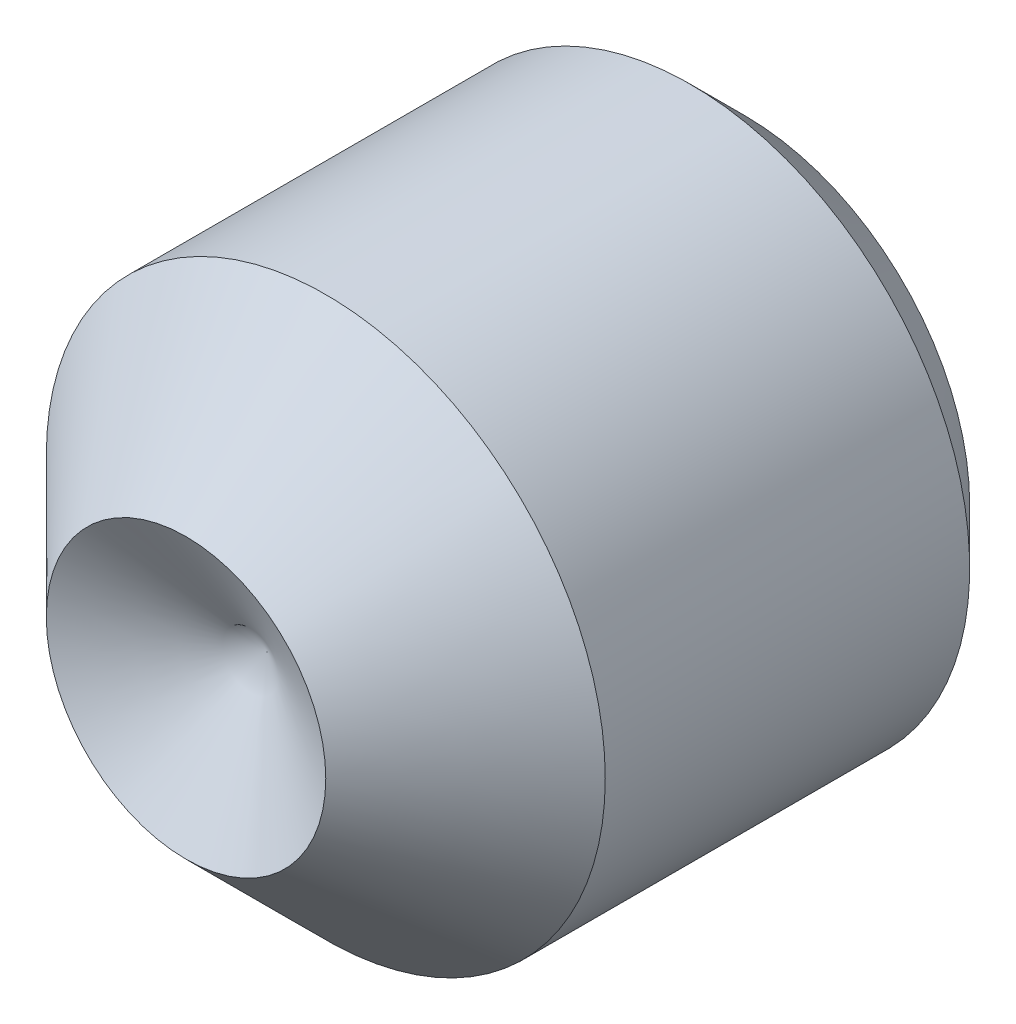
ISO-10303-21;
HEADER;
FILE_DESCRIPTION(('STEP AP214'),'2;1');
FILE_NAME('part.step','',(''),(''),'','','');
FILE_SCHEMA(('AUTOMOTIVE_DESIGN { 1 0 10303 214 1 1 1 1 }'));
ENDSEC;
DATA;
#1=APPLICATION_CONTEXT('core data for automotive mechanical design processes');
#2=APPLICATION_PROTOCOL_DEFINITION('international standard','automotive_design',2000,#1);
#3=PRODUCT_CONTEXT('',#1,'mechanical');
#4=PRODUCT('Part','Part','',(#3));
#5=PRODUCT_RELATED_PRODUCT_CATEGORY('part','',(#4));
#6=PRODUCT_DEFINITION_FORMATION('','',#4);
#7=PRODUCT_DEFINITION_CONTEXT('part definition',#1,'design');
#8=PRODUCT_DEFINITION('design','',#6,#7);
#9=PRODUCT_DEFINITION_SHAPE('','',#8);
#10=(LENGTH_UNIT() NAMED_UNIT(*) SI_UNIT(.MILLI.,.METRE.));
#11=(NAMED_UNIT(*) PLANE_ANGLE_UNIT() SI_UNIT($,.RADIAN.));
#12=(NAMED_UNIT(*) SI_UNIT($,.STERADIAN.) SOLID_ANGLE_UNIT());
#13=UNCERTAINTY_MEASURE_WITH_UNIT(LENGTH_MEASURE(1.E-05),#10,'distance_accuracy_value','');
#14=(GEOMETRIC_REPRESENTATION_CONTEXT(3) GLOBAL_UNCERTAINTY_ASSIGNED_CONTEXT((#13)) GLOBAL_UNIT_ASSIGNED_CONTEXT((#10,
#11,#12)) REPRESENTATION_CONTEXT('',''));
#15=CARTESIAN_POINT('',(0.,0.,0.));
#16=DIRECTION('',(0.,0.,1.));
#17=DIRECTION('',(1.,0.,0.));
#18=AXIS2_PLACEMENT_3D('',#15,#16,#17);
#19=CARTESIAN_POINT('',(0.,0.,-10.5851546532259));
#20=DIRECTION('',(0.,0.,-1.));
#21=DIRECTION('',(-1.,0.,0.));
#22=AXIS2_PLACEMENT_3D('',#19,#20,#21);
#23=CYLINDRICAL_SURFACE('',#22,3.175);
#24=CARTESIAN_POINT('',(0.,0.,0.622299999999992));
#25=DIRECTION('',(0.,0.,-1.));
#26=DIRECTION('',(-1.,0.,0.));
#27=AXIS2_PLACEMENT_3D('',#24,#25,#26);
#28=CIRCLE('',#27,3.175);
#29=CARTESIAN_POINT('',(-3.175,0.,0.622299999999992));
#30=VERTEX_POINT('',#29);
#31=EDGE_CURVE('E58',#30,#30,#28,.T.);
#32=ORIENTED_EDGE('',*,*,#31,.F.);
#33=EDGE_LOOP('',(#32));
#34=FACE_BOUND('',#33,.T.);
#35=CARTESIAN_POINT('',(0.,0.,4.76249999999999));
#36=DIRECTION('',(0.,0.,1.));
#37=DIRECTION('',(1.,0.,0.));
#38=AXIS2_PLACEMENT_3D('',#35,#36,#37);
#39=CIRCLE('',#38,3.175);
#40=CARTESIAN_POINT('',(3.175,0.,4.76249999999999));
#41=VERTEX_POINT('',#40);
#42=EDGE_CURVE('E188',#41,#41,#39,.T.);
#43=ORIENTED_EDGE('',*,*,#42,.F.);
#44=EDGE_LOOP('',(#43));
#45=FACE_BOUND('',#44,.T.);
#46=ADVANCED_FACE('F49',(#34,#45),#23,.T.);
#47=CARTESIAN_POINT('',(0.,0.,0.));
#48=DIRECTION('',(0.,0.,1.));
#49=DIRECTION('',(1.,0.,0.));
#50=AXIS2_PLACEMENT_3D('',#47,#48,#49);
#51=PLANE('',#50);
#52=DIRECTION('',(-0.5,-0.866025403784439,0.));
#53=VECTOR('',#52,1.);
#54=CARTESIAN_POINT('',(1.83308710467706,0.,0.));
#55=LINE('',#54,#53);
#56=CARTESIAN_POINT('',(1.83308710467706,0.,0.));
#57=VERTEX_POINT('',#56);
#58=CARTESIAN_POINT('',(0.916543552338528,-1.58750000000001,0.));
#59=VERTEX_POINT('',#58);
#60=EDGE_CURVE('E148',#57,#59,#55,.T.);
#61=ORIENTED_EDGE('',*,*,#60,.F.);
#62=DIRECTION('',(0.5,-0.866025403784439,0.));
#63=VECTOR('',#62,1.);
#64=CARTESIAN_POINT('',(0.916543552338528,1.58750000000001,0.));
#65=LINE('',#64,#63);
#66=CARTESIAN_POINT('',(0.916543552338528,1.58750000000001,0.));
#67=VERTEX_POINT('',#66);
#68=EDGE_CURVE('E65',#67,#57,#65,.T.);
#69=ORIENTED_EDGE('',*,*,#68,.F.);
#70=DIRECTION('',(1.,0.,0.));
#71=VECTOR('',#70,1.);
#72=CARTESIAN_POINT('',(-0.916543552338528,1.58750000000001,0.));
#73=LINE('',#72,#71);
#74=CARTESIAN_POINT('',(-0.916543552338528,1.58750000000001,0.));
#75=VERTEX_POINT('',#74);
#76=EDGE_CURVE('E162',#75,#67,#73,.T.);
#77=ORIENTED_EDGE('',*,*,#76,.F.);
#78=DIRECTION('',(0.5,0.866025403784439,0.));
#79=VECTOR('',#78,1.);
#80=CARTESIAN_POINT('',(-1.83308710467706,0.,0.));
#81=LINE('',#80,#79);
#82=CARTESIAN_POINT('',(-1.83308710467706,0.,0.));
#83=VERTEX_POINT('',#82);
#84=EDGE_CURVE('E159',#83,#75,#81,.T.);
#85=ORIENTED_EDGE('',*,*,#84,.F.);
#86=DIRECTION('',(-0.5,0.866025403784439,0.));
#87=VECTOR('',#86,1.);
#88=CARTESIAN_POINT('',(-0.916543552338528,-1.58750000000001,0.));
#89=LINE('',#88,#87);
#90=CARTESIAN_POINT('',(-0.916543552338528,-1.58750000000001,0.));
#91=VERTEX_POINT('',#90);
#92=EDGE_CURVE('E115',#91,#83,#89,.T.);
#93=ORIENTED_EDGE('',*,*,#92,.F.);
#94=DIRECTION('',(-1.,0.,0.));
#95=VECTOR('',#94,1.);
#96=CARTESIAN_POINT('',(0.916543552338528,-1.58750000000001,0.));
#97=LINE('',#96,#95);
#98=EDGE_CURVE('E153',#59,#91,#97,.T.);
#99=ORIENTED_EDGE('',*,*,#98,.F.);
#100=EDGE_LOOP('',(#61,#69,#77,#85,#93,#99));
#101=FACE_BOUND('',#100,.T.);
#102=CARTESIAN_POINT('',(0.,0.,0.));
#103=DIRECTION('',(0.,0.,-1.));
#104=DIRECTION('',(-1.,0.,0.));
#105=AXIS2_PLACEMENT_3D('',#102,#103,#104);
#106=CIRCLE('',#105,2.5527);
#107=CARTESIAN_POINT('',(-2.5527,0.,0.));
#108=VERTEX_POINT('',#107);
#109=EDGE_CURVE('E11',#108,#108,#106,.T.);
#110=ORIENTED_EDGE('',*,*,#109,.T.);
#111=EDGE_LOOP('',(#110));
#112=FACE_BOUND('',#111,.T.);
#113=ADVANCED_FACE('F51',(#101,#112),#51,.F.);
#114=CARTESIAN_POINT('',(0.,0.,0.622299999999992));
#115=DIRECTION('',(0.,0.,1.));
#116=DIRECTION('',(1.,0.,0.));
#117=AXIS2_PLACEMENT_3D('',#114,#115,#116);
#118=CONICAL_SURFACE('',#117,3.175,0.785398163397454);
#119=ORIENTED_EDGE('',*,*,#109,.F.);
#120=EDGE_LOOP('',(#119));
#121=FACE_BOUND('',#120,.T.);
#122=ORIENTED_EDGE('',*,*,#31,.T.);
#123=EDGE_LOOP('',(#122));
#124=FACE_BOUND('',#123,.T.);
#125=ADVANCED_FACE('F181',(#121,#124),#118,.T.);
#126=CARTESIAN_POINT('',(0.916543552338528,1.58750000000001,2.5));
#127=DIRECTION('',(0.866025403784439,0.5,0.));
#128=DIRECTION('',(-0.5,0.866025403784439,0.));
#129=AXIS2_PLACEMENT_3D('',#126,#127,#128);
#130=PLANE('',#129);
#131=ORIENTED_EDGE('',*,*,#68,.T.);
#132=DIRECTION('',(0.,0.,-1.));
#133=VECTOR('',#132,1.);
#134=CARTESIAN_POINT('',(1.83308710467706,0.,2.5));
#135=LINE('',#134,#133);
#136=CARTESIAN_POINT('',(1.83308710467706,0.,2.5));
#137=VERTEX_POINT('',#136);
#138=EDGE_CURVE('E96',#137,#57,#135,.T.);
#139=ORIENTED_EDGE('',*,*,#138,.F.);
#140=DIRECTION('',(0.5,-0.866025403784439,0.));
#141=VECTOR('',#140,1.);
#142=CARTESIAN_POINT('',(0.916543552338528,1.58750000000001,2.5));
#143=LINE('',#142,#141);
#144=CARTESIAN_POINT('',(0.916543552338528,1.58750000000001,2.5));
#145=VERTEX_POINT('',#144);
#146=EDGE_CURVE('E165',#145,#137,#143,.T.);
#147=ORIENTED_EDGE('',*,*,#146,.F.);
#148=DIRECTION('',(0.,0.,-1.));
#149=VECTOR('',#148,1.);
#150=CARTESIAN_POINT('',(0.916543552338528,1.58750000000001,2.5));
#151=LINE('',#150,#149);
#152=EDGE_CURVE('E73',#145,#67,#151,.T.);
#153=ORIENTED_EDGE('',*,*,#152,.T.);
#154=EDGE_LOOP('',(#131,#139,#147,#153));
#155=FACE_BOUND('',#154,.T.);
#156=ADVANCED_FACE('F211',(#155),#130,.F.);
#157=CARTESIAN_POINT('',(-0.916543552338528,1.58750000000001,2.5));
#158=DIRECTION('',(0.,1.,0.));
#159=DIRECTION('',(-1.,0.,0.));
#160=AXIS2_PLACEMENT_3D('',#157,#158,#159);
#161=PLANE('',#160);
#162=ORIENTED_EDGE('',*,*,#76,.T.);
#163=ORIENTED_EDGE('',*,*,#152,.F.);
#164=DIRECTION('',(1.,0.,0.));
#165=VECTOR('',#164,1.);
#166=CARTESIAN_POINT('',(-0.916543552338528,1.58750000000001,2.5));
#167=LINE('',#166,#165);
#168=CARTESIAN_POINT('',(-0.916543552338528,1.58750000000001,2.5));
#169=VERTEX_POINT('',#168);
#170=EDGE_CURVE('E129',#169,#145,#167,.T.);
#171=ORIENTED_EDGE('',*,*,#170,.F.);
#172=DIRECTION('',(0.,0.,-1.));
#173=VECTOR('',#172,1.);
#174=CARTESIAN_POINT('',(-0.916543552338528,1.58750000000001,2.5));
#175=LINE('',#174,#173);
#176=EDGE_CURVE('E120',#169,#75,#175,.T.);
#177=ORIENTED_EDGE('',*,*,#176,.T.);
#178=EDGE_LOOP('',(#162,#163,#171,#177));
#179=FACE_BOUND('',#178,.T.);
#180=ADVANCED_FACE('F209',(#179),#161,.F.);
#181=CARTESIAN_POINT('',(-1.83308710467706,0.,2.5));
#182=DIRECTION('',(-0.866025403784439,0.5,0.));
#183=DIRECTION('',(-0.5,-0.866025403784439,0.));
#184=AXIS2_PLACEMENT_3D('',#181,#182,#183);
#185=PLANE('',#184);
#186=ORIENTED_EDGE('',*,*,#84,.T.);
#187=ORIENTED_EDGE('',*,*,#176,.F.);
#188=DIRECTION('',(0.5,0.866025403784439,0.));
#189=VECTOR('',#188,1.);
#190=CARTESIAN_POINT('',(-1.83308710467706,0.,2.5));
#191=LINE('',#190,#189);
#192=CARTESIAN_POINT('',(-1.83308710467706,0.,2.5));
#193=VERTEX_POINT('',#192);
#194=EDGE_CURVE('E124',#193,#169,#191,.T.);
#195=ORIENTED_EDGE('',*,*,#194,.F.);
#196=DIRECTION('',(0.,0.,-1.));
#197=VECTOR('',#196,1.);
#198=CARTESIAN_POINT('',(-1.83308710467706,0.,2.5));
#199=LINE('',#198,#197);
#200=EDGE_CURVE('E108',#193,#83,#199,.T.);
#201=ORIENTED_EDGE('',*,*,#200,.T.);
#202=EDGE_LOOP('',(#186,#187,#195,#201));
#203=FACE_BOUND('',#202,.T.);
#204=ADVANCED_FACE('F125',(#203),#185,.F.);
#205=CARTESIAN_POINT('',(-0.916543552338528,-1.58750000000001,2.5));
#206=DIRECTION('',(-0.866025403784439,-0.5,0.));
#207=DIRECTION('',(0.5,-0.866025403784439,0.));
#208=AXIS2_PLACEMENT_3D('',#205,#206,#207);
#209=PLANE('',#208);
#210=ORIENTED_EDGE('',*,*,#92,.T.);
#211=ORIENTED_EDGE('',*,*,#200,.F.);
#212=DIRECTION('',(-0.5,0.866025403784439,0.));
#213=VECTOR('',#212,1.);
#214=CARTESIAN_POINT('',(-0.916543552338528,-1.58750000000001,2.5));
#215=LINE('',#214,#213);
#216=CARTESIAN_POINT('',(-0.916543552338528,-1.58750000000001,2.5));
#217=VERTEX_POINT('',#216);
#218=EDGE_CURVE('E112',#217,#193,#215,.T.);
#219=ORIENTED_EDGE('',*,*,#218,.F.);
#220=DIRECTION('',(0.,0.,-1.));
#221=VECTOR('',#220,1.);
#222=CARTESIAN_POINT('',(-0.916543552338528,-1.58750000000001,2.5));
#223=LINE('',#222,#221);
#224=EDGE_CURVE('E121',#217,#91,#223,.T.);
#225=ORIENTED_EDGE('',*,*,#224,.T.);
#226=EDGE_LOOP('',(#210,#211,#219,#225));
#227=FACE_BOUND('',#226,.T.);
#228=ADVANCED_FACE('F110',(#227),#209,.F.);
#229=CARTESIAN_POINT('',(0.916543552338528,-1.58750000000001,2.5));
#230=DIRECTION('',(0.,-1.,0.));
#231=DIRECTION('',(1.,0.,0.));
#232=AXIS2_PLACEMENT_3D('',#229,#230,#231);
#233=PLANE('',#232);
#234=ORIENTED_EDGE('',*,*,#98,.T.);
#235=ORIENTED_EDGE('',*,*,#224,.F.);
#236=DIRECTION('',(-1.,0.,0.));
#237=VECTOR('',#236,1.);
#238=CARTESIAN_POINT('',(0.916543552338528,-1.58750000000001,2.5));
#239=LINE('',#238,#237);
#240=CARTESIAN_POINT('',(0.916543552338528,-1.58750000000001,2.5));
#241=VERTEX_POINT('',#240);
#242=EDGE_CURVE('E135',#241,#217,#239,.T.);
#243=ORIENTED_EDGE('',*,*,#242,.F.);
#244=DIRECTION('',(0.,0.,-1.));
#245=VECTOR('',#244,1.);
#246=CARTESIAN_POINT('',(0.916543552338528,-1.58750000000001,2.5));
#247=LINE('',#246,#245);
#248=EDGE_CURVE('E172',#241,#59,#247,.T.);
#249=ORIENTED_EDGE('',*,*,#248,.T.);
#250=EDGE_LOOP('',(#234,#235,#243,#249));
#251=FACE_BOUND('',#250,.T.);
#252=ADVANCED_FACE('F205',(#251),#233,.F.);
#253=CARTESIAN_POINT('',(1.83308710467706,0.,2.5));
#254=DIRECTION('',(0.866025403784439,-0.5,0.));
#255=DIRECTION('',(0.5,0.866025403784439,0.));
#256=AXIS2_PLACEMENT_3D('',#253,#254,#255);
#257=PLANE('',#256);
#258=ORIENTED_EDGE('',*,*,#60,.T.);
#259=ORIENTED_EDGE('',*,*,#248,.F.);
#260=DIRECTION('',(-0.5,-0.866025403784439,0.));
#261=VECTOR('',#260,1.);
#262=CARTESIAN_POINT('',(1.83308710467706,0.,2.5));
#263=LINE('',#262,#261);
#264=EDGE_CURVE('E140',#137,#241,#263,.T.);
#265=ORIENTED_EDGE('',*,*,#264,.F.);
#266=ORIENTED_EDGE('',*,*,#138,.T.);
#267=EDGE_LOOP('',(#258,#259,#265,#266));
#268=FACE_BOUND('',#267,.T.);
#269=ADVANCED_FACE('F201',(#268),#257,.F.);
#270=CARTESIAN_POINT('',(0.916543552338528,1.58750000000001,2.5));
#271=DIRECTION('',(0.,0.,1.));
#272=DIRECTION('',(1.,0.,0.));
#273=AXIS2_PLACEMENT_3D('',#270,#271,#272);
#274=PLANE('',#273);
#275=ORIENTED_EDGE('',*,*,#146,.T.);
#276=ORIENTED_EDGE('',*,*,#264,.T.);
#277=ORIENTED_EDGE('',*,*,#242,.T.);
#278=ORIENTED_EDGE('',*,*,#218,.T.);
#279=ORIENTED_EDGE('',*,*,#194,.T.);
#280=ORIENTED_EDGE('',*,*,#170,.T.);
#281=EDGE_LOOP('',(#275,#276,#277,#278,#279,#280));
#282=FACE_BOUND('',#281,.T.);
#283=ADVANCED_FACE('F132',(#282),#274,.F.);
#284=CARTESIAN_POINT('',(0.,0.,5.43345644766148));
#285=DIRECTION('',(0.,0.,1.));
#286=DIRECTION('',(1.,0.,0.));
#287=AXIS2_PLACEMENT_3D('',#284,#285,#286);
#288=CONICAL_SURFACE('',#287,0.,1.0471975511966);
#289=CARTESIAN_POINT('',(0.,0.,6.35000000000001));
#290=DIRECTION('',(0.,0.,1.));
#291=DIRECTION('',(1.,0.,0.));
#292=AXIS2_PLACEMENT_3D('',#289,#290,#291);
#293=CIRCLE('',#292,1.5875);
#294=CARTESIAN_POINT('',(1.5875,0.,6.35000000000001));
#295=VERTEX_POINT('',#294);
#296=EDGE_CURVE('E149',#295,#295,#293,.T.);
#297=ORIENTED_EDGE('',*,*,#296,.T.);
#298=EDGE_LOOP('',(#297));
#299=FACE_BOUND('',#298,.T.);
#300=CARTESIAN_POINT('',(0.,0.,5.43345644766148));
#301=VERTEX_POINT('',#300);
#302=VERTEX_LOOP('',#301);
#303=FACE_BOUND('',#302,.T.);
#304=ADVANCED_FACE('F284',(#299,#303),#288,.F.);
#305=CARTESIAN_POINT('',(0.,0.,6.35000000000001));
#306=DIRECTION('',(0.,0.,-1.));
#307=DIRECTION('',(-1.,0.,0.));
#308=AXIS2_PLACEMENT_3D('',#305,#306,#307);
#309=CONICAL_SURFACE('',#308,1.5875,0.785398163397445);
#310=ORIENTED_EDGE('',*,*,#42,.T.);
#311=EDGE_LOOP('',(#310));
#312=FACE_BOUND('',#311,.T.);
#313=ORIENTED_EDGE('',*,*,#296,.F.);
#314=EDGE_LOOP('',(#313));
#315=FACE_BOUND('',#314,.T.);
#316=ADVANCED_FACE('F294',(#312,#315),#309,.T.);
#317=CLOSED_SHELL('',(#46,#113,#125,#156,#180,#204,#228,#252,#269,#283,#304,#316));
#318=MANIFOLD_SOLID_BREP('B2',#317);
#319=ADVANCED_BREP_SHAPE_REPRESENTATION('',(#18,#318),#14);
#320=SHAPE_DEFINITION_REPRESENTATION(#9,#319);
ENDSEC;
END-ISO-10303-21;
